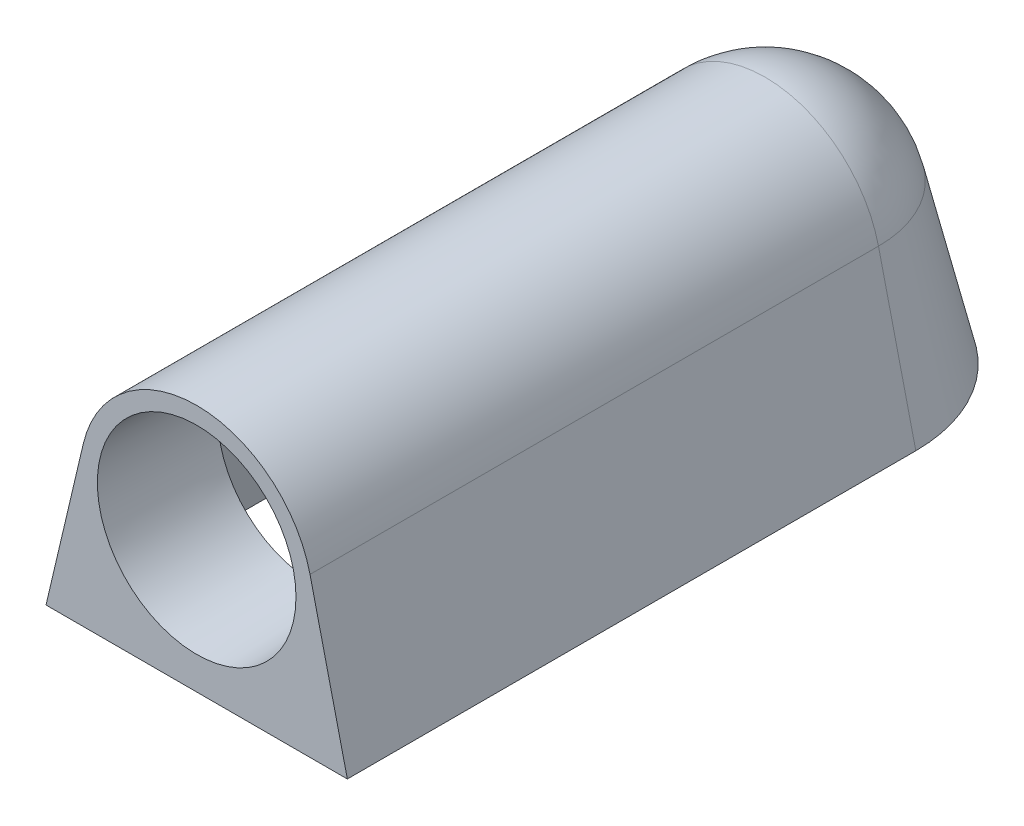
ISO-10303-21;
HEADER;
FILE_DESCRIPTION(('STEP AP214'),'2;1');
FILE_NAME('part.step','',(''),(''),'','','');
FILE_SCHEMA(('AUTOMOTIVE_DESIGN { 1 0 10303 214 1 1 1 1 }'));
ENDSEC;
DATA;
#1=APPLICATION_CONTEXT('core data for automotive mechanical design processes');
#2=APPLICATION_PROTOCOL_DEFINITION('international standard','automotive_design',2000,#1);
#3=PRODUCT_CONTEXT('',#1,'mechanical');
#4=PRODUCT('Part','Part','',(#3));
#5=PRODUCT_RELATED_PRODUCT_CATEGORY('part','',(#4));
#6=PRODUCT_DEFINITION_FORMATION('','',#4);
#7=PRODUCT_DEFINITION_CONTEXT('part definition',#1,'design');
#8=PRODUCT_DEFINITION('design','',#6,#7);
#9=PRODUCT_DEFINITION_SHAPE('','',#8);
#10=(LENGTH_UNIT() NAMED_UNIT(*) SI_UNIT(.MILLI.,.METRE.));
#11=(NAMED_UNIT(*) PLANE_ANGLE_UNIT() SI_UNIT($,.RADIAN.));
#12=(NAMED_UNIT(*) SI_UNIT($,.STERADIAN.) SOLID_ANGLE_UNIT());
#13=UNCERTAINTY_MEASURE_WITH_UNIT(LENGTH_MEASURE(1.E-05),#10,'distance_accuracy_value','');
#14=(GEOMETRIC_REPRESENTATION_CONTEXT(3) GLOBAL_UNCERTAINTY_ASSIGNED_CONTEXT((#13)) GLOBAL_UNIT_ASSIGNED_CONTEXT((#10,
#11,#12)) REPRESENTATION_CONTEXT('',''));
#15=CARTESIAN_POINT('',(0.,0.,0.));
#16=DIRECTION('',(0.,0.,1.));
#17=DIRECTION('',(1.,0.,0.));
#18=AXIS2_PLACEMENT_3D('',#15,#16,#17);
#19=CARTESIAN_POINT('',(-11.176,0.,0.));
#20=DIRECTION('',(0.,-1.,0.));
#21=DIRECTION('',(0.,0.,-1.));
#22=AXIS2_PLACEMENT_3D('',#19,#20,#21);
#23=PLANE('',#22);
#24=CARTESIAN_POINT('',(0.,0.,0.));
#25=DIRECTION('',(0.,-1.,0.));
#26=DIRECTION('',(0.,0.,-1.));
#27=AXIS2_PLACEMENT_3D('',#24,#25,#26);
#28=CIRCLE('',#27,9.87123814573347);
#29=CARTESIAN_POINT('',(-9.87123814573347,0.,0.));
#30=VERTEX_POINT('',#29);
#31=CARTESIAN_POINT('',(9.87123814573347,0.,0.));
#32=VERTEX_POINT('',#31);
#33=EDGE_CURVE('E127',#30,#32,#28,.T.);
#34=ORIENTED_EDGE('',*,*,#33,.F.);
#35=DIRECTION('',(0.,0.,-1.));
#36=VECTOR('',#35,1.);
#37=CARTESIAN_POINT('',(-9.87123814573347,0.,42.164));
#38=LINE('',#37,#36);
#39=CARTESIAN_POINT('',(-9.87123814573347,0.,40.894));
#40=VERTEX_POINT('',#39);
#41=EDGE_CURVE('E141',#40,#30,#38,.T.);
#42=ORIENTED_EDGE('',*,*,#41,.F.);
#43=DIRECTION('',(1.,0.,0.));
#44=VECTOR('',#43,1.);
#45=CARTESIAN_POINT('',(0.,0.,40.894));
#46=LINE('',#45,#44);
#47=CARTESIAN_POINT('',(9.87123814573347,0.,40.894));
#48=VERTEX_POINT('',#47);
#49=EDGE_CURVE('E44',#40,#48,#46,.T.);
#50=ORIENTED_EDGE('',*,*,#49,.T.);
#51=DIRECTION('',(0.,0.,-1.));
#52=VECTOR('',#51,1.);
#53=CARTESIAN_POINT('',(9.87123814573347,0.,0.));
#54=LINE('',#53,#52);
#55=EDGE_CURVE('E149',#48,#32,#54,.T.);
#56=ORIENTED_EDGE('',*,*,#55,.T.);
#57=EDGE_LOOP('',(#34,#42,#50,#56));
#58=FACE_BOUND('',#57,.T.);
#59=CARTESIAN_POINT('',(0.,0.,0.));
#60=DIRECTION('',(0.,-1.,0.));
#61=DIRECTION('',(0.,0.,-1.));
#62=AXIS2_PLACEMENT_3D('',#59,#60,#61);
#63=CIRCLE('',#62,11.176);
#64=CARTESIAN_POINT('',(-11.176,0.,0.));
#65=VERTEX_POINT('',#64);
#66=CARTESIAN_POINT('',(11.176,0.,0.));
#67=VERTEX_POINT('',#66);
#68=EDGE_CURVE('E37',#65,#67,#63,.T.);
#69=ORIENTED_EDGE('',*,*,#68,.T.);
#70=DIRECTION('',(0.,0.,-1.));
#71=VECTOR('',#70,1.);
#72=CARTESIAN_POINT('',(11.176,0.,42.164));
#73=LINE('',#72,#71);
#74=CARTESIAN_POINT('',(11.176,0.,42.164));
#75=VERTEX_POINT('',#74);
#76=EDGE_CURVE('E234',#75,#67,#73,.T.);
#77=ORIENTED_EDGE('',*,*,#76,.F.);
#78=DIRECTION('',(1.,0.,0.));
#79=VECTOR('',#78,1.);
#80=CARTESIAN_POINT('',(-11.176,0.,42.164));
#81=LINE('',#80,#79);
#82=CARTESIAN_POINT('',(-11.176,0.,42.164));
#83=VERTEX_POINT('',#82);
#84=EDGE_CURVE('E249',#83,#75,#81,.T.);
#85=ORIENTED_EDGE('',*,*,#84,.F.);
#86=DIRECTION('',(0.,0.,-1.));
#87=VECTOR('',#86,1.);
#88=CARTESIAN_POINT('',(-11.176,0.,42.164));
#89=LINE('',#88,#87);
#90=EDGE_CURVE('E229',#83,#65,#89,.T.);
#91=ORIENTED_EDGE('',*,*,#90,.T.);
#92=EDGE_LOOP('',(#69,#77,#85,#91));
#93=FACE_BOUND('',#92,.T.);
#94=ADVANCED_FACE('F29',(#58,#93),#23,.T.);
#95=CARTESIAN_POINT('',(0.,9.779,0.));
#96=DIRECTION('',(0.,-1.,0.));
#97=DIRECTION('',(-1.,0.,0.));
#98=AXIS2_PLACEMENT_3D('',#95,#96,#97);
#99=SPHERICAL_SURFACE('',#98,8.636);
#100=CARTESIAN_POINT('',(0.,11.7591650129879,0.));
#101=DIRECTION('',(0.,-1.,0.));
#102=DIRECTION('',(0.,0.,-1.));
#103=AXIS2_PLACEMENT_3D('',#100,#101,#102);
#104=CIRCLE('',#103,8.40591711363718);
#105=CARTESIAN_POINT('',(-8.40591711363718,11.7591650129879,0.));
#106=VERTEX_POINT('',#105);
#107=CARTESIAN_POINT('',(8.40591711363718,11.7591650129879,0.));
#108=VERTEX_POINT('',#107);
#109=EDGE_CURVE('E11',#106,#108,#104,.T.);
#110=ORIENTED_EDGE('',*,*,#109,.F.);
#111=CARTESIAN_POINT('',(0.,9.779,0.));
#112=DIRECTION('',(0.,0.,-1.));
#113=DIRECTION('',(1.,0.,0.));
#114=AXIS2_PLACEMENT_3D('',#111,#112,#113);
#115=CIRCLE('',#114,8.636);
#116=EDGE_CURVE('E224',#106,#108,#115,.T.);
#117=ORIENTED_EDGE('',*,*,#116,.T.);
#118=EDGE_LOOP('',(#110,#117));
#119=FACE_BOUND('',#118,.T.);
#120=ADVANCED_FACE('F31',(#119),#99,.T.);
#121=CARTESIAN_POINT('',(0.,0.,0.));
#122=DIRECTION('',(0.,-1.,0.));
#123=DIRECTION('',(0.,0.,-1.));
#124=AXIS2_PLACEMENT_3D('',#121,#122,#123);
#125=CONICAL_SURFACE('',#124,11.176,0.231350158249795);
#126=DIRECTION('',(0.229291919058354,0.973357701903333,0.));
#127=VECTOR('',#126,1.);
#128=CARTESIAN_POINT('',(-8.40591711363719,11.7591650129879,0.));
#129=LINE('',#128,#127);
#130=EDGE_CURVE('E218',#65,#106,#129,.T.);
#131=ORIENTED_EDGE('',*,*,#130,.T.);
#132=ORIENTED_EDGE('',*,*,#109,.T.);
#133=DIRECTION('',(-0.229291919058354,0.973357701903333,0.));
#134=VECTOR('',#133,1.);
#135=CARTESIAN_POINT('',(8.40591711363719,11.7591650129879,0.));
#136=LINE('',#135,#134);
#137=EDGE_CURVE('E225',#67,#108,#136,.T.);
#138=ORIENTED_EDGE('',*,*,#137,.F.);
#139=ORIENTED_EDGE('',*,*,#68,.F.);
#140=EDGE_LOOP('',(#131,#132,#138,#139));
#141=FACE_BOUND('',#140,.T.);
#142=ADVANCED_FACE('F205',(#141),#125,.T.);
#143=CARTESIAN_POINT('',(-8.40591711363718,11.7591650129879,42.164));
#144=DIRECTION('',(0.973357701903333,-0.229291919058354,0.));
#145=DIRECTION('',(0.229291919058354,0.973357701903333,0.));
#146=AXIS2_PLACEMENT_3D('',#143,#144,#145);
#147=PLANE('',#146);
#148=ORIENTED_EDGE('',*,*,#130,.F.);
#149=ORIENTED_EDGE('',*,*,#90,.F.);
#150=DIRECTION('',(-0.229291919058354,-0.973357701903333,0.));
#151=VECTOR('',#150,1.);
#152=CARTESIAN_POINT('',(-8.40591711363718,11.7591650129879,42.164));
#153=LINE('',#152,#151);
#154=CARTESIAN_POINT('',(-8.40591711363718,11.7591650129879,42.164));
#155=VERTEX_POINT('',#154);
#156=EDGE_CURVE('E240',#155,#83,#153,.T.);
#157=ORIENTED_EDGE('',*,*,#156,.F.);
#158=DIRECTION('',(0.,0.,-1.));
#159=VECTOR('',#158,1.);
#160=CARTESIAN_POINT('',(-8.40591711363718,11.7591650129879,42.164));
#161=LINE('',#160,#159);
#162=EDGE_CURVE('E237',#155,#106,#161,.T.);
#163=ORIENTED_EDGE('',*,*,#162,.T.);
#164=EDGE_LOOP('',(#148,#149,#157,#163));
#165=FACE_BOUND('',#164,.T.);
#166=ADVANCED_FACE('F201',(#165),#147,.F.);
#167=CARTESIAN_POINT('',(11.176,0.,42.164));
#168=DIRECTION('',(-0.973357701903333,-0.229291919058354,0.));
#169=DIRECTION('',(0.229291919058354,-0.973357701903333,0.));
#170=AXIS2_PLACEMENT_3D('',#167,#168,#169);
#171=PLANE('',#170);
#172=ORIENTED_EDGE('',*,*,#137,.T.);
#173=DIRECTION('',(0.,0.,-1.));
#174=VECTOR('',#173,1.);
#175=CARTESIAN_POINT('',(8.40591711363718,11.7591650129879,42.164));
#176=LINE('',#175,#174);
#177=CARTESIAN_POINT('',(8.40591711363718,11.7591650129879,42.164));
#178=VERTEX_POINT('',#177);
#179=EDGE_CURVE('E52',#178,#108,#176,.T.);
#180=ORIENTED_EDGE('',*,*,#179,.F.);
#181=DIRECTION('',(-0.229291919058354,0.973357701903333,0.));
#182=VECTOR('',#181,1.);
#183=CARTESIAN_POINT('',(11.176,0.,42.164));
#184=LINE('',#183,#182);
#185=EDGE_CURVE('E244',#75,#178,#184,.T.);
#186=ORIENTED_EDGE('',*,*,#185,.F.);
#187=ORIENTED_EDGE('',*,*,#76,.T.);
#188=EDGE_LOOP('',(#172,#180,#186,#187));
#189=FACE_BOUND('',#188,.T.);
#190=ADVANCED_FACE('F198',(#189),#171,.F.);
#191=CARTESIAN_POINT('',(0.,9.779,42.164));
#192=DIRECTION('',(0.,0.,-1.));
#193=DIRECTION('',(-1.,0.,0.));
#194=AXIS2_PLACEMENT_3D('',#191,#192,#193);
#195=CYLINDRICAL_SURFACE('',#194,8.636);
#196=ORIENTED_EDGE('',*,*,#116,.F.);
#197=ORIENTED_EDGE('',*,*,#162,.F.);
#198=CARTESIAN_POINT('',(0.,9.779,42.164));
#199=DIRECTION('',(0.,0.,1.));
#200=DIRECTION('',(1.,0.,0.));
#201=AXIS2_PLACEMENT_3D('',#198,#199,#200);
#202=CIRCLE('',#201,8.636);
#203=EDGE_CURVE('E241',#178,#155,#202,.T.);
#204=ORIENTED_EDGE('',*,*,#203,.F.);
#205=ORIENTED_EDGE('',*,*,#179,.T.);
#206=EDGE_LOOP('',(#196,#197,#204,#205));
#207=FACE_BOUND('',#206,.T.);
#208=ADVANCED_FACE('F194',(#207),#195,.T.);
#209=CARTESIAN_POINT('',(0.,9.779,42.164));
#210=DIRECTION('',(0.,0.,1.));
#211=DIRECTION('',(1.,0.,0.));
#212=AXIS2_PLACEMENT_3D('',#209,#210,#211);
#213=PLANE('',#212);
#214=CARTESIAN_POINT('',(0.,9.779,42.164));
#215=DIRECTION('',(0.,0.,1.));
#216=DIRECTION('',(1.,0.,0.));
#217=AXIS2_PLACEMENT_3D('',#214,#215,#216);
#218=CIRCLE('',#217,7.366);
#219=CARTESIAN_POINT('',(7.366,9.779,42.164));
#220=VERTEX_POINT('',#219);
#221=EDGE_CURVE('E252',#220,#220,#218,.T.);
#222=ORIENTED_EDGE('',*,*,#221,.F.);
#223=EDGE_LOOP('',(#222));
#224=FACE_BOUND('',#223,.T.);
#225=ORIENTED_EDGE('',*,*,#156,.T.);
#226=ORIENTED_EDGE('',*,*,#84,.T.);
#227=ORIENTED_EDGE('',*,*,#185,.T.);
#228=ORIENTED_EDGE('',*,*,#203,.T.);
#229=EDGE_LOOP('',(#225,#226,#227,#228));
#230=FACE_BOUND('',#229,.T.);
#231=ADVANCED_FACE('F190',(#224,#230),#213,.T.);
#232=CARTESIAN_POINT('',(0.,9.779,42.164));
#233=DIRECTION('',(0.,0.,1.));
#234=DIRECTION('',(1.,0.,0.));
#235=AXIS2_PLACEMENT_3D('',#232,#233,#234);
#236=CONICAL_SURFACE('',#235,7.366,0.0349065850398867);
#237=CARTESIAN_POINT('',(0.,9.779,33.528));
#238=DIRECTION('',(0.,0.,1.));
#239=DIRECTION('',(1.,0.,0.));
#240=AXIS2_PLACEMENT_3D('',#237,#238,#239);
#241=CIRCLE('',#240,7.06442423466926);
#242=CARTESIAN_POINT('',(7.06442423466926,9.779,33.528));
#243=VERTEX_POINT('',#242);
#244=EDGE_CURVE('E253',#243,#243,#241,.T.);
#245=ORIENTED_EDGE('',*,*,#244,.F.);
#246=EDGE_LOOP('',(#245));
#247=FACE_BOUND('',#246,.T.);
#248=ORIENTED_EDGE('',*,*,#221,.T.);
#249=EDGE_LOOP('',(#248));
#250=FACE_BOUND('',#249,.T.);
#251=ADVANCED_FACE('F186',(#247,#250),#236,.F.);
#252=CARTESIAN_POINT('',(-7.16975283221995,11.4679642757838,42.164));
#253=DIRECTION('',(0.973357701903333,-0.229291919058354,0.));
#254=DIRECTION('',(0.229291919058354,0.973357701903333,0.));
#255=AXIS2_PLACEMENT_3D('',#252,#253,#254);
#256=PLANE('',#255);
#257=DIRECTION('',(-0.229291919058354,-0.973357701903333,0.));
#258=VECTOR('',#257,1.);
#259=CARTESIAN_POINT('',(-7.16975283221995,11.4679642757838,33.528));
#260=LINE('',#259,#258);
#261=CARTESIAN_POINT('',(-7.16975283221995,11.4679642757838,33.528));
#262=VERTEX_POINT('',#261);
#263=CARTESIAN_POINT('',(-8.06421398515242,7.6709239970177,33.528));
#264=VERTEX_POINT('',#263);
#265=EDGE_CURVE('E260',#262,#264,#260,.T.);
#266=ORIENTED_EDGE('',*,*,#265,.T.);
#267=CARTESIAN_POINT('',(-8.3697847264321,6.37375820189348,53.5958137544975));
#268=CARTESIAN_POINT('',(-8.355147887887,6.43589244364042,52.53708788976));
#269=CARTESIAN_POINT('',(-8.34033540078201,6.49877232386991,51.4784084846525));
#270=CARTESIAN_POINT('',(-8.31031275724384,6.6262202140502,49.3611563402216));
#271=CARTESIAN_POINT('',(-8.2951026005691,6.69078822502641,48.3025836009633));
#272=CARTESIAN_POINT('',(-8.24880691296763,6.8873161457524,45.1271040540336));
#273=CARTESIAN_POINT('',(-8.21705539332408,7.02210321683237,43.0103797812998));
#274=CARTESIAN_POINT('',(-8.16768367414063,7.23168907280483,39.8357936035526));
#275=CARTESIAN_POINT('',(-8.15093555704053,7.30278581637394,38.7776733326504));
#276=CARTESIAN_POINT('',(-8.11675817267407,7.44787082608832,36.661643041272));
#277=CARTESIAN_POINT('',(-8.09932890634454,7.52185908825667,35.6037330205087));
#278=CARTESIAN_POINT('',(-8.06367035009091,7.6732317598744,33.4881413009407));
#279=CARTESIAN_POINT('',(-8.04544103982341,7.75061625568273,32.43045960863));
#280=CARTESIAN_POINT('',(-8.00800818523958,7.90952092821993,30.3154195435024));
#281=CARTESIAN_POINT('',(-7.98880463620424,7.99104112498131,29.2580611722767));
#282=CARTESIAN_POINT('',(-7.96902674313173,8.07499944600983,28.2009036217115));
#283=B_SPLINE_CURVE_WITH_KNOTS('',3,(#267,#268,#269,#270,#271,#272,#273,#274,#275,#276,#277,
#278,#279,#280,#281,#282),.UNSPECIFIED.,.F.,.F.,(4,2,2,2,2,2,2,4),(0.,3.18194466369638,
6.36389126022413,12.7276157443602,15.9095276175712,19.0914351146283,22.273423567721,
25.4554274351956),.UNSPECIFIED.);
#284=CARTESIAN_POINT('',(-8.18414108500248,7.16182639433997,40.894));
#285=VERTEX_POINT('',#284);
#286=EDGE_CURVE('E137',#285,#264,#283,.T.);
#287=ORIENTED_EDGE('',*,*,#286,.F.);
#288=DIRECTION('',(-0.229291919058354,-0.973357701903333,0.));
#289=VECTOR('',#288,1.);
#290=CARTESIAN_POINT('',(-7.16975283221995,11.4679642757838,40.894));
#291=LINE('',#290,#289);
#292=EDGE_CURVE('E145',#285,#40,#291,.T.);
#293=ORIENTED_EDGE('',*,*,#292,.T.);
#294=ORIENTED_EDGE('',*,*,#41,.T.);
#295=DIRECTION('',(-0.229291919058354,-0.973357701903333,0.));
#296=VECTOR('',#295,1.);
#297=CARTESIAN_POINT('',(-9.93983571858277,-0.29120073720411,0.));
#298=LINE('',#297,#296);
#299=CARTESIAN_POINT('',(-7.16975283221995,11.4679642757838,0.));
#300=VERTEX_POINT('',#299);
#301=EDGE_CURVE('E128',#30,#300,#298,.F.);
#302=ORIENTED_EDGE('',*,*,#301,.T.);
#303=DIRECTION('',(0.,0.,1.));
#304=VECTOR('',#303,1.);
#305=CARTESIAN_POINT('',(-7.16975283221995,11.4679642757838,42.164));
#306=LINE('',#305,#304);
#307=EDGE_CURVE('E109',#262,#300,#306,.F.);
#308=ORIENTED_EDGE('',*,*,#307,.F.);
#309=EDGE_LOOP('',(#266,#287,#293,#294,#302,#308));
#310=FACE_BOUND('',#309,.T.);
#311=ADVANCED_FACE('F139',(#310),#256,.T.);
#312=CARTESIAN_POINT('',(0.,9.779,0.));
#313=DIRECTION('',(0.,-1.,0.));
#314=DIRECTION('',(-1.,0.,0.));
#315=AXIS2_PLACEMENT_3D('',#312,#313,#314);
#316=SPHERICAL_SURFACE('',#315,7.366);
#317=CARTESIAN_POINT('',(0.,11.4679642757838,0.));
#318=DIRECTION('',(0.,-1.,0.));
#319=DIRECTION('',(0.,0.,-1.));
#320=AXIS2_PLACEMENT_3D('',#317,#318,#319);
#321=CIRCLE('',#320,7.16975283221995);
#322=CARTESIAN_POINT('',(7.16975283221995,11.4679642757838,0.));
#323=VERTEX_POINT('',#322);
#324=EDGE_CURVE('E126',#300,#323,#321,.T.);
#325=ORIENTED_EDGE('',*,*,#324,.T.);
#326=CARTESIAN_POINT('',(0.,9.779,0.));
#327=DIRECTION('',(0.,0.,-1.));
#328=DIRECTION('',(-1.,0.,0.));
#329=AXIS2_PLACEMENT_3D('',#326,#327,#328);
#330=CIRCLE('',#329,7.366);
#331=EDGE_CURVE('E113',#300,#323,#330,.T.);
#332=ORIENTED_EDGE('',*,*,#331,.F.);
#333=EDGE_LOOP('',(#325,#332));
#334=FACE_BOUND('',#333,.T.);
#335=ADVANCED_FACE('F125',(#334),#316,.F.);
#336=CARTESIAN_POINT('',(0.,-0.29120073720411,0.));
#337=DIRECTION('',(0.,-1.,0.));
#338=DIRECTION('',(0.,0.,-1.));
#339=AXIS2_PLACEMENT_3D('',#336,#337,#338);
#340=CONICAL_SURFACE('',#339,9.93983571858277,0.231350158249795);
#341=ORIENTED_EDGE('',*,*,#301,.F.);
#342=ORIENTED_EDGE('',*,*,#33,.T.);
#343=DIRECTION('',(0.229291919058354,-0.973357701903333,0.));
#344=VECTOR('',#343,1.);
#345=CARTESIAN_POINT('',(9.93983571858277,-0.29120073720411,0.));
#346=LINE('',#345,#344);
#347=EDGE_CURVE('E136',#32,#323,#346,.F.);
#348=ORIENTED_EDGE('',*,*,#347,.T.);
#349=ORIENTED_EDGE('',*,*,#324,.F.);
#350=EDGE_LOOP('',(#341,#342,#348,#349));
#351=FACE_BOUND('',#350,.T.);
#352=ADVANCED_FACE('F133',(#351),#340,.F.);
#353=CARTESIAN_POINT('',(9.93983571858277,-0.29120073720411,42.164));
#354=DIRECTION('',(-0.973357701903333,-0.229291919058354,0.));
#355=DIRECTION('',(0.229291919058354,-0.973357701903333,0.));
#356=AXIS2_PLACEMENT_3D('',#353,#354,#355);
#357=PLANE('',#356);
#358=DIRECTION('',(0.,0.,-1.));
#359=VECTOR('',#358,1.);
#360=CARTESIAN_POINT('',(7.16975283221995,11.4679642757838,42.164));
#361=LINE('',#360,#359);
#362=CARTESIAN_POINT('',(7.16975283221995,11.4679642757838,33.528));
#363=VERTEX_POINT('',#362);
#364=EDGE_CURVE('E120',#363,#323,#361,.T.);
#365=ORIENTED_EDGE('',*,*,#364,.T.);
#366=ORIENTED_EDGE('',*,*,#347,.F.);
#367=ORIENTED_EDGE('',*,*,#55,.F.);
#368=DIRECTION('',(-0.229291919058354,0.973357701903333,0.));
#369=VECTOR('',#368,1.);
#370=CARTESIAN_POINT('',(9.93983571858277,-0.29120073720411,40.894));
#371=LINE('',#370,#369);
#372=CARTESIAN_POINT('',(8.18414108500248,7.16182639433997,40.894));
#373=VERTEX_POINT('',#372);
#374=EDGE_CURVE('E121',#48,#373,#371,.T.);
#375=ORIENTED_EDGE('',*,*,#374,.T.);
#376=CARTESIAN_POINT('',(8.3697847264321,6.37375820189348,53.5958137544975));
#377=CARTESIAN_POINT('',(8.355147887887,6.43589244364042,52.53708788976));
#378=CARTESIAN_POINT('',(8.34033540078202,6.49877232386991,51.4784084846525));
#379=CARTESIAN_POINT('',(8.31031275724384,6.6262202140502,49.3611563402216));
#380=CARTESIAN_POINT('',(8.2951026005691,6.69078822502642,48.3025836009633));
#381=CARTESIAN_POINT('',(8.24880691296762,6.8873161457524,45.1271040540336));
#382=CARTESIAN_POINT('',(8.21705539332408,7.02210321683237,43.0103797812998));
#383=CARTESIAN_POINT('',(8.16768367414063,7.23168907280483,39.8357936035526));
#384=CARTESIAN_POINT('',(8.15093555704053,7.30278581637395,38.7776733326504));
#385=CARTESIAN_POINT('',(8.11675817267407,7.44787082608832,36.661643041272));
#386=CARTESIAN_POINT('',(8.09932890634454,7.52185908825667,35.6037330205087));
#387=CARTESIAN_POINT('',(8.06367035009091,7.6732317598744,33.4881413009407));
#388=CARTESIAN_POINT('',(8.04544103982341,7.75061625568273,32.43045960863));
#389=CARTESIAN_POINT('',(8.00800818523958,7.90952092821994,30.3154195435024));
#390=CARTESIAN_POINT('',(7.98880463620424,7.99104112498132,29.2580611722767));
#391=CARTESIAN_POINT('',(7.96902674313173,8.07499944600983,28.2009036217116));
#392=B_SPLINE_CURVE_WITH_KNOTS('',3,(#376,#377,#378,#379,#380,#381,#382,#383,#384,#385,#386,
#387,#388,#389,#390,#391),.UNSPECIFIED.,.F.,.F.,(4,2,2,2,2,2,2,4),(0.,3.18194466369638,
6.36389126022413,12.7276157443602,15.9095276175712,19.0914351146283,22.273423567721,
25.4554274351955),.UNSPECIFIED.);
#393=CARTESIAN_POINT('',(8.06421398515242,7.67092399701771,33.528));
#394=VERTEX_POINT('',#393);
#395=EDGE_CURVE('E169',#373,#394,#392,.T.);
#396=ORIENTED_EDGE('',*,*,#395,.T.);
#397=DIRECTION('',(0.229291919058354,-0.973357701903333,0.));
#398=VECTOR('',#397,1.);
#399=CARTESIAN_POINT('',(7.16975283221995,11.4679642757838,33.528));
#400=LINE('',#399,#398);
#401=EDGE_CURVE('E259',#363,#394,#400,.T.);
#402=ORIENTED_EDGE('',*,*,#401,.F.);
#403=EDGE_LOOP('',(#365,#366,#367,#375,#396,#402));
#404=FACE_BOUND('',#403,.T.);
#405=ADVANCED_FACE('F263',(#404),#357,.T.);
#406=CARTESIAN_POINT('',(0.,9.779,42.164));
#407=DIRECTION('',(0.,0.,-1.));
#408=DIRECTION('',(-1.,0.,0.));
#409=AXIS2_PLACEMENT_3D('',#406,#407,#408);
#410=CYLINDRICAL_SURFACE('',#409,7.366);
#411=ORIENTED_EDGE('',*,*,#307,.T.);
#412=ORIENTED_EDGE('',*,*,#331,.T.);
#413=ORIENTED_EDGE('',*,*,#364,.F.);
#414=CARTESIAN_POINT('',(0.,9.779,33.528));
#415=DIRECTION('',(0.,0.,1.));
#416=DIRECTION('',(1.,0.,0.));
#417=AXIS2_PLACEMENT_3D('',#414,#415,#416);
#418=CIRCLE('',#417,7.366);
#419=EDGE_CURVE('E116',#262,#363,#418,.F.);
#420=ORIENTED_EDGE('',*,*,#419,.F.);
#421=EDGE_LOOP('',(#411,#412,#413,#420));
#422=FACE_BOUND('',#421,.T.);
#423=ADVANCED_FACE('F111',(#422),#410,.F.);
#424=CARTESIAN_POINT('',(0.,9.779,40.894));
#425=DIRECTION('',(0.,0.,1.));
#426=DIRECTION('',(1.,0.,0.));
#427=AXIS2_PLACEMENT_3D('',#424,#425,#426);
#428=PLANE('',#427);
#429=CARTESIAN_POINT('',(0.,9.779,40.894));
#430=DIRECTION('',(0.,0.,1.));
#431=DIRECTION('',(1.,0.,0.));
#432=AXIS2_PLACEMENT_3D('',#429,#430,#431);
#433=CIRCLE('',#432,8.59242474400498);
#434=EDGE_CURVE('E152',#285,#373,#433,.T.);
#435=ORIENTED_EDGE('',*,*,#434,.T.);
#436=ORIENTED_EDGE('',*,*,#374,.F.);
#437=ORIENTED_EDGE('',*,*,#49,.F.);
#438=ORIENTED_EDGE('',*,*,#292,.F.);
#439=EDGE_LOOP('',(#435,#436,#437,#438));
#440=FACE_BOUND('',#439,.T.);
#441=ADVANCED_FACE('F183',(#440),#428,.F.);
#442=CARTESIAN_POINT('',(0.,9.779,42.1196776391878));
#443=DIRECTION('',(0.,0.,1.));
#444=DIRECTION('',(1.,0.,0.));
#445=AXIS2_PLACEMENT_3D('',#442,#443,#444);
#446=CONICAL_SURFACE('',#445,8.63522635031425,0.0349065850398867);
#447=ORIENTED_EDGE('',*,*,#434,.F.);
#448=ORIENTED_EDGE('',*,*,#286,.T.);
#449=CARTESIAN_POINT('',(0.,9.779,33.528));
#450=DIRECTION('',(0.,0.,1.));
#451=DIRECTION('',(1.,0.,0.));
#452=AXIS2_PLACEMENT_3D('',#449,#450,#451);
#453=CIRCLE('',#452,8.33519835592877);
#454=EDGE_CURVE('E146',#264,#394,#453,.T.);
#455=ORIENTED_EDGE('',*,*,#454,.T.);
#456=ORIENTED_EDGE('',*,*,#395,.F.);
#457=EDGE_LOOP('',(#447,#448,#455,#456));
#458=FACE_BOUND('',#457,.T.);
#459=ADVANCED_FACE('F177',(#458),#446,.T.);
#460=CARTESIAN_POINT('',(0.,9.779,33.528));
#461=DIRECTION('',(0.,0.,1.));
#462=DIRECTION('',(1.,0.,0.));
#463=AXIS2_PLACEMENT_3D('',#460,#461,#462);
#464=PLANE('',#463);
#465=ORIENTED_EDGE('',*,*,#244,.T.);
#466=EDGE_LOOP('',(#465));
#467=FACE_BOUND('',#466,.T.);
#468=ORIENTED_EDGE('',*,*,#419,.T.);
#469=ORIENTED_EDGE('',*,*,#401,.T.);
#470=ORIENTED_EDGE('',*,*,#454,.F.);
#471=ORIENTED_EDGE('',*,*,#265,.F.);
#472=EDGE_LOOP('',(#468,#469,#470,#471));
#473=FACE_BOUND('',#472,.T.);
#474=ADVANCED_FACE('F182',(#467,#473),#464,.F.);
#475=CLOSED_SHELL('',(#94,#120,#142,#166,#190,#208,#231,#251,#311,#335,#352,#405,#423,#441,#459,#474));
#476=MANIFOLD_SOLID_BREP('B2',#475);
#477=ADVANCED_BREP_SHAPE_REPRESENTATION('',(#18,#476),#14);
#478=SHAPE_DEFINITION_REPRESENTATION(#9,#477);
ENDSEC;
END-ISO-10303-21;
